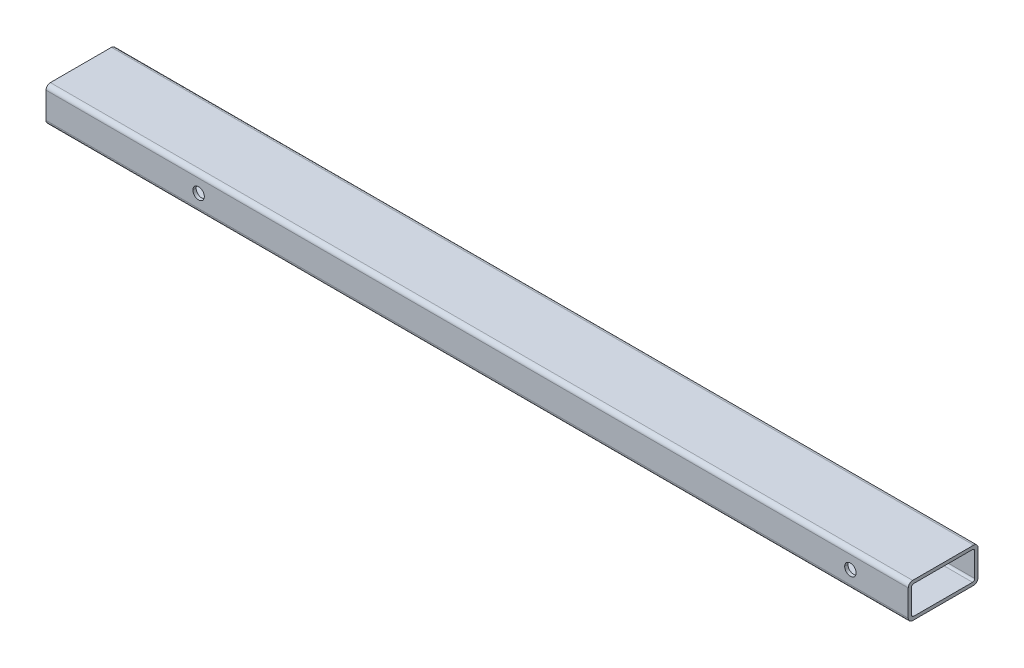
ISO-10303-21;
HEADER;
FILE_DESCRIPTION(('STEP AP214'),'2;1');
FILE_NAME('part.step','',(''),(''),'','','');
FILE_SCHEMA(('AUTOMOTIVE_DESIGN { 1 0 10303 214 1 1 1 1 }'));
ENDSEC;
DATA;
#1=APPLICATION_CONTEXT('core data for automotive mechanical design processes');
#2=APPLICATION_PROTOCOL_DEFINITION('international standard','automotive_design',2000,#1);
#3=PRODUCT_CONTEXT('',#1,'mechanical');
#4=PRODUCT('Part','Part','',(#3));
#5=PRODUCT_RELATED_PRODUCT_CATEGORY('part','',(#4));
#6=PRODUCT_DEFINITION_FORMATION('','',#4);
#7=PRODUCT_DEFINITION_CONTEXT('part definition',#1,'design');
#8=PRODUCT_DEFINITION('design','',#6,#7);
#9=PRODUCT_DEFINITION_SHAPE('','',#8);
#10=(LENGTH_UNIT() NAMED_UNIT(*) SI_UNIT(.MILLI.,.METRE.));
#11=(NAMED_UNIT(*) PLANE_ANGLE_UNIT() SI_UNIT($,.RADIAN.));
#12=(NAMED_UNIT(*) SI_UNIT($,.STERADIAN.) SOLID_ANGLE_UNIT());
#13=UNCERTAINTY_MEASURE_WITH_UNIT(LENGTH_MEASURE(1.E-05),#10,'distance_accuracy_value','');
#14=(GEOMETRIC_REPRESENTATION_CONTEXT(3) GLOBAL_UNCERTAINTY_ASSIGNED_CONTEXT((#13)) GLOBAL_UNIT_ASSIGNED_CONTEXT((#10,
#11,#12)) REPRESENTATION_CONTEXT('',''));
#15=CARTESIAN_POINT('',(0.,0.,0.));
#16=DIRECTION('',(0.,0.,1.));
#17=DIRECTION('',(1.,0.,0.));
#18=AXIS2_PLACEMENT_3D('',#15,#16,#17);
#19=CARTESIAN_POINT('',(-405.661151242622,0.,47.625));
#20=DIRECTION('',(0.,0.,1.));
#21=DIRECTION('',(1.,0.,0.));
#22=AXIS2_PLACEMENT_3D('',#19,#20,#21);
#23=CYLINDRICAL_SURFACE('',#22,8.334375);
#24=CARTESIAN_POINT('',(-405.661151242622,0.,50.8));
#25=DIRECTION('',(0.,0.,1.));
#26=DIRECTION('',(1.,0.,0.));
#27=AXIS2_PLACEMENT_3D('',#24,#25,#26);
#28=CIRCLE('',#27,8.334375);
#29=CARTESIAN_POINT('',(-413.995526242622,0.,50.8));
#30=VERTEX_POINT('',#29);
#31=CARTESIAN_POINT('',(-397.326776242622,0.,50.8));
#32=VERTEX_POINT('',#31);
#33=EDGE_CURVE('E175',#30,#32,#28,.F.);
#34=ORIENTED_EDGE('',*,*,#33,.F.);
#35=DIRECTION('',(0.,0.,1.));
#36=VECTOR('',#35,1.);
#37=CARTESIAN_POINT('',(-413.995526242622,0.,47.625));
#38=LINE('',#37,#36);
#39=CARTESIAN_POINT('',(-413.995526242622,0.,46.0375));
#40=VERTEX_POINT('',#39);
#41=EDGE_CURVE('E150',#30,#40,#38,.F.);
#42=ORIENTED_EDGE('',*,*,#41,.T.);
#43=CARTESIAN_POINT('',(-405.661151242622,0.,46.0375));
#44=DIRECTION('',(0.,0.,1.));
#45=DIRECTION('',(1.,0.,0.));
#46=AXIS2_PLACEMENT_3D('',#43,#44,#45);
#47=CIRCLE('',#46,8.334375);
#48=CARTESIAN_POINT('',(-397.326776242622,0.,46.0375));
#49=VERTEX_POINT('',#48);
#50=EDGE_CURVE('E19',#40,#49,#47,.F.);
#51=ORIENTED_EDGE('',*,*,#50,.T.);
#52=DIRECTION('',(0.,0.,1.));
#53=VECTOR('',#52,1.);
#54=CARTESIAN_POINT('',(-397.326776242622,0.,47.625));
#55=LINE('',#54,#53);
#56=EDGE_CURVE('E154',#49,#32,#55,.T.);
#57=ORIENTED_EDGE('',*,*,#56,.T.);
#58=EDGE_LOOP('',(#34,#42,#51,#57));
#59=FACE_BOUND('',#58,.T.);
#60=ADVANCED_FACE('F16',(#59),#23,.F.);
#61=CARTESIAN_POINT('',(-405.661151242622,0.,47.625));
#62=DIRECTION('',(0.,0.,1.));
#63=DIRECTION('',(1.,0.,0.));
#64=AXIS2_PLACEMENT_3D('',#61,#62,#63);
#65=CYLINDRICAL_SURFACE('',#64,8.334375);
#66=CARTESIAN_POINT('',(-405.661151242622,0.,46.0375));
#67=DIRECTION('',(0.,0.,1.));
#68=DIRECTION('',(1.,0.,0.));
#69=AXIS2_PLACEMENT_3D('',#66,#67,#68);
#70=CIRCLE('',#69,8.334375);
#71=EDGE_CURVE('E158',#49,#40,#70,.F.);
#72=ORIENTED_EDGE('',*,*,#71,.T.);
#73=ORIENTED_EDGE('',*,*,#41,.F.);
#74=CARTESIAN_POINT('',(-405.661151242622,0.,50.8));
#75=DIRECTION('',(0.,0.,1.));
#76=DIRECTION('',(1.,0.,0.));
#77=AXIS2_PLACEMENT_3D('',#74,#75,#76);
#78=CIRCLE('',#77,8.334375);
#79=EDGE_CURVE('E163',#32,#30,#78,.F.);
#80=ORIENTED_EDGE('',*,*,#79,.F.);
#81=ORIENTED_EDGE('',*,*,#56,.F.);
#82=EDGE_LOOP('',(#72,#73,#80,#81));
#83=FACE_BOUND('',#82,.T.);
#84=ADVANCED_FACE('F161',(#83),#65,.F.);
#85=CARTESIAN_POINT('',(543.663848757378,0.,47.625));
#86=DIRECTION('',(0.,0.,1.));
#87=DIRECTION('',(1.,0.,0.));
#88=AXIS2_PLACEMENT_3D('',#85,#86,#87);
#89=CYLINDRICAL_SURFACE('',#88,8.334375);
#90=CARTESIAN_POINT('',(543.663848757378,0.,50.8));
#91=DIRECTION('',(0.,0.,1.));
#92=DIRECTION('',(1.,0.,0.));
#93=AXIS2_PLACEMENT_3D('',#90,#91,#92);
#94=CIRCLE('',#93,8.334375);
#95=CARTESIAN_POINT('',(535.329473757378,0.,50.8));
#96=VERTEX_POINT('',#95);
#97=CARTESIAN_POINT('',(551.998223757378,0.,50.8));
#98=VERTEX_POINT('',#97);
#99=EDGE_CURVE('E179',#96,#98,#94,.F.);
#100=ORIENTED_EDGE('',*,*,#99,.F.);
#101=DIRECTION('',(0.,0.,1.));
#102=VECTOR('',#101,1.);
#103=CARTESIAN_POINT('',(535.329473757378,0.,47.625));
#104=LINE('',#103,#102);
#105=CARTESIAN_POINT('',(535.329473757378,0.,46.0375));
#106=VERTEX_POINT('',#105);
#107=EDGE_CURVE('E165',#96,#106,#104,.F.);
#108=ORIENTED_EDGE('',*,*,#107,.T.);
#109=CARTESIAN_POINT('',(543.663848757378,0.,46.0375));
#110=DIRECTION('',(0.,0.,1.));
#111=DIRECTION('',(1.,0.,0.));
#112=AXIS2_PLACEMENT_3D('',#109,#110,#111);
#113=CIRCLE('',#112,8.334375);
#114=CARTESIAN_POINT('',(551.998223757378,0.,46.0375));
#115=VERTEX_POINT('',#114);
#116=EDGE_CURVE('E168',#106,#115,#113,.F.);
#117=ORIENTED_EDGE('',*,*,#116,.T.);
#118=DIRECTION('',(0.,0.,1.));
#119=VECTOR('',#118,1.);
#120=CARTESIAN_POINT('',(551.998223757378,0.,47.625));
#121=LINE('',#120,#119);
#122=EDGE_CURVE('E246',#115,#98,#121,.T.);
#123=ORIENTED_EDGE('',*,*,#122,.T.);
#124=EDGE_LOOP('',(#100,#108,#117,#123));
#125=FACE_BOUND('',#124,.T.);
#126=ADVANCED_FACE('F495',(#125),#89,.F.);
#127=CARTESIAN_POINT('',(543.663848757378,0.,47.625));
#128=DIRECTION('',(0.,0.,1.));
#129=DIRECTION('',(1.,0.,0.));
#130=AXIS2_PLACEMENT_3D('',#127,#128,#129);
#131=CYLINDRICAL_SURFACE('',#130,8.334375);
#132=CARTESIAN_POINT('',(543.663848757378,0.,46.0375));
#133=DIRECTION('',(0.,0.,1.));
#134=DIRECTION('',(1.,0.,0.));
#135=AXIS2_PLACEMENT_3D('',#132,#133,#134);
#136=CIRCLE('',#135,8.334375);
#137=EDGE_CURVE('E169',#115,#106,#136,.F.);
#138=ORIENTED_EDGE('',*,*,#137,.T.);
#139=ORIENTED_EDGE('',*,*,#107,.F.);
#140=CARTESIAN_POINT('',(543.663848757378,0.,50.8));
#141=DIRECTION('',(0.,0.,1.));
#142=DIRECTION('',(1.,0.,0.));
#143=AXIS2_PLACEMENT_3D('',#140,#141,#142);
#144=CIRCLE('',#143,8.334375);
#145=EDGE_CURVE('E182',#98,#96,#144,.F.);
#146=ORIENTED_EDGE('',*,*,#145,.F.);
#147=ORIENTED_EDGE('',*,*,#122,.F.);
#148=EDGE_LOOP('',(#138,#139,#146,#147));
#149=FACE_BOUND('',#148,.T.);
#150=ADVANCED_FACE('F488',(#149),#131,.F.);
#151=CARTESIAN_POINT('',(-627.910973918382,-17.4625,-42.8625));
#152=DIRECTION('',(1.,0.,0.));
#153=DIRECTION('',(0.,0.,-1.));
#154=AXIS2_PLACEMENT_3D('',#151,#152,#153);
#155=CYLINDRICAL_SURFACE('',#154,3.175);
#156=DIRECTION('',(1.,0.,0.));
#157=VECTOR('',#156,1.);
#158=CARTESIAN_POINT('',(-627.910973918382,-17.4625,-46.0375000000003));
#159=LINE('',#158,#157);
#160=CARTESIAN_POINT('',(627.910973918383,-17.4625,-46.0375000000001));
#161=VERTEX_POINT('',#160);
#162=CARTESIAN_POINT('',(-627.910973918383,-17.4625,-46.0375000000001));
#163=VERTEX_POINT('',#162);
#164=EDGE_CURVE('E248',#161,#163,#159,.F.);
#165=ORIENTED_EDGE('',*,*,#164,.T.);
#166=CARTESIAN_POINT('',(-627.910973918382,-17.4625,-42.8625));
#167=DIRECTION('',(1.,0.,0.));
#168=DIRECTION('',(0.,0.,-1.));
#169=AXIS2_PLACEMENT_3D('',#166,#167,#168);
#170=CIRCLE('',#169,3.175);
#171=CARTESIAN_POINT('',(-627.910973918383,-20.6375,-42.8625));
#172=VERTEX_POINT('',#171);
#173=EDGE_CURVE('E211',#172,#163,#170,.T.);
#174=ORIENTED_EDGE('',*,*,#173,.F.);
#175=DIRECTION('',(1.,0.,0.));
#176=VECTOR('',#175,1.);
#177=CARTESIAN_POINT('',(-627.910973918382,-20.6375,-42.8625));
#178=LINE('',#177,#176);
#179=CARTESIAN_POINT('',(627.910973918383,-20.6375,-42.8625));
#180=VERTEX_POINT('',#179);
#181=EDGE_CURVE('E259',#172,#180,#178,.T.);
#182=ORIENTED_EDGE('',*,*,#181,.T.);
#183=CARTESIAN_POINT('',(627.910973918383,-17.4625,-42.8625));
#184=DIRECTION('',(1.,0.,0.));
#185=DIRECTION('',(0.,0.,-1.));
#186=AXIS2_PLACEMENT_3D('',#183,#184,#185);
#187=CIRCLE('',#186,3.175);
#188=EDGE_CURVE('E196',#180,#161,#187,.T.);
#189=ORIENTED_EDGE('',*,*,#188,.T.);
#190=EDGE_LOOP('',(#165,#174,#182,#189));
#191=FACE_BOUND('',#190,.T.);
#192=ADVANCED_FACE('F376',(#191),#155,.F.);
#193=CARTESIAN_POINT('',(-627.910973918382,17.4625,-46.0375000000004));
#194=DIRECTION('',(0.,0.,-1.));
#195=DIRECTION('',(0.,1.,0.));
#196=AXIS2_PLACEMENT_3D('',#193,#194,#195);
#197=PLANE('',#196);
#198=DIRECTION('',(1.,0.,0.));
#199=VECTOR('',#198,1.);
#200=CARTESIAN_POINT('',(-627.910973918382,17.4625,-46.0375000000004));
#201=LINE('',#200,#199);
#202=CARTESIAN_POINT('',(627.910973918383,17.4625,-46.0375000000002));
#203=VERTEX_POINT('',#202);
#204=CARTESIAN_POINT('',(-627.910973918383,17.4625,-46.0375000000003));
#205=VERTEX_POINT('',#204);
#206=EDGE_CURVE('E250',#203,#205,#201,.F.);
#207=ORIENTED_EDGE('',*,*,#206,.T.);
#208=DIRECTION('',(0.,1.,0.));
#209=VECTOR('',#208,1.);
#210=CARTESIAN_POINT('',(-627.910973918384,0.,-46.0375));
#211=LINE('',#210,#209);
#212=EDGE_CURVE('E214',#163,#205,#211,.T.);
#213=ORIENTED_EDGE('',*,*,#212,.F.);
#214=ORIENTED_EDGE('',*,*,#164,.F.);
#215=DIRECTION('',(0.,1.,0.));
#216=VECTOR('',#215,1.);
#217=CARTESIAN_POINT('',(627.910973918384,-19.05,-46.0375));
#218=LINE('',#217,#216);
#219=EDGE_CURVE('E189',#161,#203,#218,.T.);
#220=ORIENTED_EDGE('',*,*,#219,.T.);
#221=EDGE_LOOP('',(#207,#213,#214,#220));
#222=FACE_BOUND('',#221,.T.);
#223=ADVANCED_FACE('F373',(#222),#197,.F.);
#224=CARTESIAN_POINT('',(-627.910973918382,17.4625,-42.8625000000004));
#225=DIRECTION('',(1.,0.,0.));
#226=DIRECTION('',(0.,0.,-1.));
#227=AXIS2_PLACEMENT_3D('',#224,#225,#226);
#228=CYLINDRICAL_SURFACE('',#227,3.175);
#229=DIRECTION('',(1.,0.,0.));
#230=VECTOR('',#229,1.);
#231=CARTESIAN_POINT('',(-627.910973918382,20.6375000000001,-42.8625000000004));
#232=LINE('',#231,#230);
#233=CARTESIAN_POINT('',(627.910973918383,20.6375,-42.8625000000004));
#234=VERTEX_POINT('',#233);
#235=CARTESIAN_POINT('',(-627.910973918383,20.6375000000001,-42.8625000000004));
#236=VERTEX_POINT('',#235);
#237=EDGE_CURVE('E252',#234,#236,#232,.F.);
#238=ORIENTED_EDGE('',*,*,#237,.T.);
#239=CARTESIAN_POINT('',(-627.910973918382,17.4625,-42.8625000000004));
#240=DIRECTION('',(1.,0.,0.));
#241=DIRECTION('',(0.,0.,-1.));
#242=AXIS2_PLACEMENT_3D('',#239,#240,#241);
#243=CIRCLE('',#242,3.175);
#244=EDGE_CURVE('E215',#205,#236,#243,.T.);
#245=ORIENTED_EDGE('',*,*,#244,.F.);
#246=ORIENTED_EDGE('',*,*,#206,.F.);
#247=CARTESIAN_POINT('',(627.910973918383,17.4625,-42.8625000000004));
#248=DIRECTION('',(1.,0.,0.));
#249=DIRECTION('',(0.,0.,-1.));
#250=AXIS2_PLACEMENT_3D('',#247,#248,#249);
#251=CIRCLE('',#250,3.175);
#252=EDGE_CURVE('E186',#203,#234,#251,.T.);
#253=ORIENTED_EDGE('',*,*,#252,.T.);
#254=EDGE_LOOP('',(#238,#245,#246,#253));
#255=FACE_BOUND('',#254,.T.);
#256=ADVANCED_FACE('F370',(#255),#228,.F.);
#257=CARTESIAN_POINT('',(-627.910973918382,20.6375,42.8625));
#258=DIRECTION('',(0.,1.,0.));
#259=DIRECTION('',(0.,0.,1.));
#260=AXIS2_PLACEMENT_3D('',#257,#258,#259);
#261=PLANE('',#260);
#262=DIRECTION('',(1.,0.,0.));
#263=VECTOR('',#262,1.);
#264=CARTESIAN_POINT('',(-627.910973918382,20.6375,42.8625));
#265=LINE('',#264,#263);
#266=CARTESIAN_POINT('',(627.910973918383,20.6375,42.8625));
#267=VERTEX_POINT('',#266);
#268=CARTESIAN_POINT('',(-627.910973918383,20.6375,42.8625));
#269=VERTEX_POINT('',#268);
#270=EDGE_CURVE('E159',#267,#269,#265,.F.);
#271=ORIENTED_EDGE('',*,*,#270,.T.);
#272=DIRECTION('',(0.,0.,1.));
#273=VECTOR('',#272,1.);
#274=CARTESIAN_POINT('',(-627.910973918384,20.6375,0.));
#275=LINE('',#274,#273);
#276=EDGE_CURVE('E218',#236,#269,#275,.T.);
#277=ORIENTED_EDGE('',*,*,#276,.F.);
#278=ORIENTED_EDGE('',*,*,#237,.F.);
#279=DIRECTION('',(0.,0.,1.));
#280=VECTOR('',#279,1.);
#281=CARTESIAN_POINT('',(627.910973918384,20.6375,-50.8));
#282=LINE('',#281,#280);
#283=EDGE_CURVE('E188',#234,#267,#282,.T.);
#284=ORIENTED_EDGE('',*,*,#283,.T.);
#285=EDGE_LOOP('',(#271,#277,#278,#284));
#286=FACE_BOUND('',#285,.T.);
#287=ADVANCED_FACE('F366',(#286),#261,.F.);
#288=CARTESIAN_POINT('',(-627.910973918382,17.4625,42.8625));
#289=DIRECTION('',(1.,0.,0.));
#290=DIRECTION('',(0.,0.,-1.));
#291=AXIS2_PLACEMENT_3D('',#288,#289,#290);
#292=CYLINDRICAL_SURFACE('',#291,3.175);
#293=DIRECTION('',(1.,0.,0.));
#294=VECTOR('',#293,1.);
#295=CARTESIAN_POINT('',(-627.910973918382,17.4625,46.0375000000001));
#296=LINE('',#295,#294);
#297=CARTESIAN_POINT('',(627.910973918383,17.4625,46.0375));
#298=VERTEX_POINT('',#297);
#299=CARTESIAN_POINT('',(-627.910973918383,17.4625,46.0375000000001));
#300=VERTEX_POINT('',#299);
#301=EDGE_CURVE('E174',#298,#300,#296,.F.);
#302=ORIENTED_EDGE('',*,*,#301,.T.);
#303=CARTESIAN_POINT('',(-627.910973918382,17.4625,42.8625));
#304=DIRECTION('',(1.,0.,0.));
#305=DIRECTION('',(0.,0.,-1.));
#306=AXIS2_PLACEMENT_3D('',#303,#304,#305);
#307=CIRCLE('',#306,3.175);
#308=EDGE_CURVE('E219',#269,#300,#307,.T.);
#309=ORIENTED_EDGE('',*,*,#308,.F.);
#310=ORIENTED_EDGE('',*,*,#270,.F.);
#311=CARTESIAN_POINT('',(627.910973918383,17.4625,42.8625));
#312=DIRECTION('',(1.,0.,0.));
#313=DIRECTION('',(0.,0.,-1.));
#314=AXIS2_PLACEMENT_3D('',#311,#312,#313);
#315=CIRCLE('',#314,3.175);
#316=EDGE_CURVE('E190',#267,#298,#315,.T.);
#317=ORIENTED_EDGE('',*,*,#316,.T.);
#318=EDGE_LOOP('',(#302,#309,#310,#317));
#319=FACE_BOUND('',#318,.T.);
#320=ADVANCED_FACE('F362',(#319),#292,.F.);
#321=CARTESIAN_POINT('',(-627.910973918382,-17.4625,46.0375));
#322=DIRECTION('',(0.,0.,1.));
#323=DIRECTION('',(0.,-1.,0.));
#324=AXIS2_PLACEMENT_3D('',#321,#322,#323);
#325=PLANE('',#324);
#326=DIRECTION('',(1.,0.,0.));
#327=VECTOR('',#326,1.);
#328=CARTESIAN_POINT('',(-627.910973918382,-17.4625,46.0375));
#329=LINE('',#328,#327);
#330=CARTESIAN_POINT('',(627.910973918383,-17.4625,46.0375));
#331=VERTEX_POINT('',#330);
#332=CARTESIAN_POINT('',(-627.910973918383,-17.4625,46.0375));
#333=VERTEX_POINT('',#332);
#334=EDGE_CURVE('E256',#331,#333,#329,.F.);
#335=ORIENTED_EDGE('',*,*,#334,.T.);
#336=DIRECTION('',(0.,1.,0.));
#337=VECTOR('',#336,1.);
#338=CARTESIAN_POINT('',(-627.910973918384,0.,46.0375));
#339=LINE('',#338,#337);
#340=EDGE_CURVE('E222',#300,#333,#339,.F.);
#341=ORIENTED_EDGE('',*,*,#340,.F.);
#342=ORIENTED_EDGE('',*,*,#301,.F.);
#343=DIRECTION('',(0.,1.,0.));
#344=VECTOR('',#343,1.);
#345=CARTESIAN_POINT('',(627.910973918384,-19.05,46.0375));
#346=LINE('',#345,#344);
#347=EDGE_CURVE('E192',#298,#331,#346,.F.);
#348=ORIENTED_EDGE('',*,*,#347,.T.);
#349=EDGE_LOOP('',(#335,#341,#342,#348));
#350=FACE_BOUND('',#349,.T.);
#351=ORIENTED_EDGE('',*,*,#116,.F.);
#352=ORIENTED_EDGE('',*,*,#137,.F.);
#353=EDGE_LOOP('',(#351,#352));
#354=FACE_BOUND('',#353,.T.);
#355=ORIENTED_EDGE('',*,*,#50,.F.);
#356=ORIENTED_EDGE('',*,*,#71,.F.);
#357=EDGE_LOOP('',(#355,#356));
#358=FACE_BOUND('',#357,.T.);
#359=ADVANCED_FACE('F167',(#350,#354,#358),#325,.F.);
#360=CARTESIAN_POINT('',(-627.910973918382,-17.4625,42.8625));
#361=DIRECTION('',(1.,0.,0.));
#362=DIRECTION('',(0.,0.,-1.));
#363=AXIS2_PLACEMENT_3D('',#360,#361,#362);
#364=CYLINDRICAL_SURFACE('',#363,3.175);
#365=DIRECTION('',(1.,0.,0.));
#366=VECTOR('',#365,1.);
#367=CARTESIAN_POINT('',(-627.910973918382,-20.6374999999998,42.8625));
#368=LINE('',#367,#366);
#369=CARTESIAN_POINT('',(627.910973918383,-20.6374999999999,42.8625));
#370=VERTEX_POINT('',#369);
#371=CARTESIAN_POINT('',(-627.910973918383,-20.6374999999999,42.8625));
#372=VERTEX_POINT('',#371);
#373=EDGE_CURVE('E258',#370,#372,#368,.F.);
#374=ORIENTED_EDGE('',*,*,#373,.T.);
#375=CARTESIAN_POINT('',(-627.910973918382,-17.4625,42.8625));
#376=DIRECTION('',(1.,0.,0.));
#377=DIRECTION('',(0.,0.,-1.));
#378=AXIS2_PLACEMENT_3D('',#375,#376,#377);
#379=CIRCLE('',#378,3.175);
#380=EDGE_CURVE('E223',#333,#372,#379,.T.);
#381=ORIENTED_EDGE('',*,*,#380,.F.);
#382=ORIENTED_EDGE('',*,*,#334,.F.);
#383=CARTESIAN_POINT('',(627.910973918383,-17.4625,42.8625));
#384=DIRECTION('',(1.,0.,0.));
#385=DIRECTION('',(0.,0.,-1.));
#386=AXIS2_PLACEMENT_3D('',#383,#384,#385);
#387=CIRCLE('',#386,3.175);
#388=EDGE_CURVE('E193',#331,#370,#387,.T.);
#389=ORIENTED_EDGE('',*,*,#388,.T.);
#390=EDGE_LOOP('',(#374,#381,#382,#389));
#391=FACE_BOUND('',#390,.T.);
#392=ADVANCED_FACE('F351',(#391),#364,.F.);
#393=CARTESIAN_POINT('',(-627.910973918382,-20.6375,-42.8625));
#394=DIRECTION('',(0.,-1.,0.));
#395=DIRECTION('',(0.,0.,-1.));
#396=AXIS2_PLACEMENT_3D('',#393,#394,#395);
#397=PLANE('',#396);
#398=ORIENTED_EDGE('',*,*,#181,.F.);
#399=DIRECTION('',(0.,0.,1.));
#400=VECTOR('',#399,1.);
#401=CARTESIAN_POINT('',(-627.910973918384,-20.6375,0.));
#402=LINE('',#401,#400);
#403=EDGE_CURVE('E226',#372,#172,#402,.F.);
#404=ORIENTED_EDGE('',*,*,#403,.F.);
#405=ORIENTED_EDGE('',*,*,#373,.F.);
#406=DIRECTION('',(0.,0.,1.));
#407=VECTOR('',#406,1.);
#408=CARTESIAN_POINT('',(627.910973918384,-20.6375,-50.8));
#409=LINE('',#408,#407);
#410=EDGE_CURVE('E195',#370,#180,#409,.F.);
#411=ORIENTED_EDGE('',*,*,#410,.T.);
#412=EDGE_LOOP('',(#398,#404,#405,#411));
#413=FACE_BOUND('',#412,.T.);
#414=ADVANCED_FACE('F347',(#413),#397,.F.);
#415=CARTESIAN_POINT('',(-627.910973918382,19.05,-50.8));
#416=DIRECTION('',(0.,0.,-1.));
#417=DIRECTION('',(-1.,0.,0.));
#418=AXIS2_PLACEMENT_3D('',#415,#416,#417);
#419=PLANE('',#418);
#420=DIRECTION('',(0.,1.,0.));
#421=VECTOR('',#420,1.);
#422=CARTESIAN_POINT('',(-627.910973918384,0.,-50.8));
#423=LINE('',#422,#421);
#424=CARTESIAN_POINT('',(-627.910973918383,19.05,-50.8));
#425=VERTEX_POINT('',#424);
#426=CARTESIAN_POINT('',(-627.910973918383,-19.05,-50.8));
#427=VERTEX_POINT('',#426);
#428=EDGE_CURVE('E231',#425,#427,#423,.F.);
#429=ORIENTED_EDGE('',*,*,#428,.F.);
#430=DIRECTION('',(1.,0.,0.));
#431=VECTOR('',#430,1.);
#432=CARTESIAN_POINT('',(-627.910973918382,19.05,-50.8));
#433=LINE('',#432,#431);
#434=CARTESIAN_POINT('',(627.910973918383,19.05,-50.8));
#435=VERTEX_POINT('',#434);
#436=EDGE_CURVE('E210',#435,#425,#433,.F.);
#437=ORIENTED_EDGE('',*,*,#436,.F.);
#438=DIRECTION('',(0.,1.,0.));
#439=VECTOR('',#438,1.);
#440=CARTESIAN_POINT('',(627.910973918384,-19.05,-50.8));
#441=LINE('',#440,#439);
#442=CARTESIAN_POINT('',(627.910973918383,-19.05,-50.8));
#443=VERTEX_POINT('',#442);
#444=EDGE_CURVE('E207',#435,#443,#441,.F.);
#445=ORIENTED_EDGE('',*,*,#444,.T.);
#446=DIRECTION('',(1.,0.,0.));
#447=VECTOR('',#446,1.);
#448=CARTESIAN_POINT('',(-627.910973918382,-19.05,-50.8));
#449=LINE('',#448,#447);
#450=EDGE_CURVE('E261',#427,#443,#449,.T.);
#451=ORIENTED_EDGE('',*,*,#450,.F.);
#452=EDGE_LOOP('',(#429,#437,#445,#451));
#453=FACE_BOUND('',#452,.T.);
#454=ADVANCED_FACE('F322',(#453),#419,.T.);
#455=CARTESIAN_POINT('',(-627.910973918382,-19.05,-44.45));
#456=DIRECTION('',(1.,0.,0.));
#457=DIRECTION('',(0.,0.,-1.));
#458=AXIS2_PLACEMENT_3D('',#455,#456,#457);
#459=CYLINDRICAL_SURFACE('',#458,6.35);
#460=CARTESIAN_POINT('',(-627.910973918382,-19.05,-44.45));
#461=DIRECTION('',(1.,0.,0.));
#462=DIRECTION('',(0.,0.,-1.));
#463=AXIS2_PLACEMENT_3D('',#460,#461,#462);
#464=CIRCLE('',#463,6.35);
#465=CARTESIAN_POINT('',(-627.910973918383,-25.4,-44.45));
#466=VERTEX_POINT('',#465);
#467=EDGE_CURVE('E227',#427,#466,#464,.F.);
#468=ORIENTED_EDGE('',*,*,#467,.F.);
#469=ORIENTED_EDGE('',*,*,#450,.T.);
#470=CARTESIAN_POINT('',(627.910973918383,-19.05,-44.45));
#471=DIRECTION('',(1.,0.,0.));
#472=DIRECTION('',(0.,0.,-1.));
#473=AXIS2_PLACEMENT_3D('',#470,#471,#472);
#474=CIRCLE('',#473,6.35);
#475=CARTESIAN_POINT('',(627.910973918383,-25.4,-44.45));
#476=VERTEX_POINT('',#475);
#477=EDGE_CURVE('E203',#443,#476,#474,.F.);
#478=ORIENTED_EDGE('',*,*,#477,.T.);
#479=DIRECTION('',(1.,0.,0.));
#480=VECTOR('',#479,1.);
#481=CARTESIAN_POINT('',(-627.910973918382,-25.4,-44.45));
#482=LINE('',#481,#480);
#483=EDGE_CURVE('E265',#466,#476,#482,.T.);
#484=ORIENTED_EDGE('',*,*,#483,.F.);
#485=EDGE_LOOP('',(#468,#469,#478,#484));
#486=FACE_BOUND('',#485,.T.);
#487=ADVANCED_FACE('F326',(#486),#459,.T.);
#488=CARTESIAN_POINT('',(-627.910973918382,-25.4,-44.45));
#489=DIRECTION('',(0.,-1.,0.));
#490=DIRECTION('',(0.,0.,-1.));
#491=AXIS2_PLACEMENT_3D('',#488,#489,#490);
#492=PLANE('',#491);
#493=DIRECTION('',(0.,0.,1.));
#494=VECTOR('',#493,1.);
#495=CARTESIAN_POINT('',(-627.910973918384,-25.4,0.));
#496=LINE('',#495,#494);
#497=CARTESIAN_POINT('',(-627.910973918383,-25.4,44.45));
#498=VERTEX_POINT('',#497);
#499=EDGE_CURVE('E230',#466,#498,#496,.T.);
#500=ORIENTED_EDGE('',*,*,#499,.F.);
#501=ORIENTED_EDGE('',*,*,#483,.T.);
#502=DIRECTION('',(0.,0.,1.));
#503=VECTOR('',#502,1.);
#504=CARTESIAN_POINT('',(627.910973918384,-25.4,-50.8));
#505=LINE('',#504,#503);
#506=CARTESIAN_POINT('',(627.910973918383,-25.4,44.45));
#507=VERTEX_POINT('',#506);
#508=EDGE_CURVE('E199',#476,#507,#505,.T.);
#509=ORIENTED_EDGE('',*,*,#508,.T.);
#510=DIRECTION('',(1.,0.,0.));
#511=VECTOR('',#510,1.);
#512=CARTESIAN_POINT('',(-627.910973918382,-25.4,44.45));
#513=LINE('',#512,#511);
#514=EDGE_CURVE('E177',#498,#507,#513,.T.);
#515=ORIENTED_EDGE('',*,*,#514,.F.);
#516=EDGE_LOOP('',(#500,#501,#509,#515));
#517=FACE_BOUND('',#516,.T.);
#518=ADVANCED_FACE('F329',(#517),#492,.T.);
#519=CARTESIAN_POINT('',(-627.910973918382,-19.05,44.45));
#520=DIRECTION('',(1.,0.,0.));
#521=DIRECTION('',(0.,0.,-1.));
#522=AXIS2_PLACEMENT_3D('',#519,#520,#521);
#523=CYLINDRICAL_SURFACE('',#522,6.35);
#524=CARTESIAN_POINT('',(-627.910973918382,-19.05,44.45));
#525=DIRECTION('',(1.,0.,0.));
#526=DIRECTION('',(0.,0.,-1.));
#527=AXIS2_PLACEMENT_3D('',#524,#525,#526);
#528=CIRCLE('',#527,6.35);
#529=CARTESIAN_POINT('',(-627.910973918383,-19.05,50.8));
#530=VERTEX_POINT('',#529);
#531=EDGE_CURVE('E232',#498,#530,#528,.F.);
#532=ORIENTED_EDGE('',*,*,#531,.F.);
#533=ORIENTED_EDGE('',*,*,#514,.T.);
#534=CARTESIAN_POINT('',(627.910973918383,-19.05,44.45));
#535=DIRECTION('',(1.,0.,0.));
#536=DIRECTION('',(0.,0.,-1.));
#537=AXIS2_PLACEMENT_3D('',#534,#535,#536);
#538=CIRCLE('',#537,6.35);
#539=CARTESIAN_POINT('',(627.910973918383,-19.05,50.8));
#540=VERTEX_POINT('',#539);
#541=EDGE_CURVE('E200',#507,#540,#538,.F.);
#542=ORIENTED_EDGE('',*,*,#541,.T.);
#543=DIRECTION('',(1.,0.,0.));
#544=VECTOR('',#543,1.);
#545=CARTESIAN_POINT('',(-627.910973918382,-19.05,50.8));
#546=LINE('',#545,#544);
#547=EDGE_CURVE('E185',#530,#540,#546,.T.);
#548=ORIENTED_EDGE('',*,*,#547,.F.);
#549=EDGE_LOOP('',(#532,#533,#542,#548));
#550=FACE_BOUND('',#549,.T.);
#551=ADVANCED_FACE('F333',(#550),#523,.T.);
#552=CARTESIAN_POINT('',(-627.910973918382,-19.05,50.8));
#553=DIRECTION('',(0.,0.,1.));
#554=DIRECTION('',(1.,0.,0.));
#555=AXIS2_PLACEMENT_3D('',#552,#553,#554);
#556=PLANE('',#555);
#557=DIRECTION('',(0.,1.,0.));
#558=VECTOR('',#557,1.);
#559=CARTESIAN_POINT('',(-627.910973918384,0.,50.8));
#560=LINE('',#559,#558);
#561=CARTESIAN_POINT('',(-627.910973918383,19.05,50.8));
#562=VERTEX_POINT('',#561);
#563=EDGE_CURVE('E235',#530,#562,#560,.T.);
#564=ORIENTED_EDGE('',*,*,#563,.F.);
#565=ORIENTED_EDGE('',*,*,#547,.T.);
#566=DIRECTION('',(0.,1.,0.));
#567=VECTOR('',#566,1.);
#568=CARTESIAN_POINT('',(627.910973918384,-19.05,50.8));
#569=LINE('',#568,#567);
#570=CARTESIAN_POINT('',(627.910973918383,19.05,50.8));
#571=VERTEX_POINT('',#570);
#572=EDGE_CURVE('E202',#540,#571,#569,.T.);
#573=ORIENTED_EDGE('',*,*,#572,.T.);
#574=DIRECTION('',(1.,0.,0.));
#575=VECTOR('',#574,1.);
#576=CARTESIAN_POINT('',(-627.910973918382,19.05,50.8));
#577=LINE('',#576,#575);
#578=EDGE_CURVE('E243',#562,#571,#577,.T.);
#579=ORIENTED_EDGE('',*,*,#578,.F.);
#580=EDGE_LOOP('',(#564,#565,#573,#579));
#581=FACE_BOUND('',#580,.T.);
#582=ORIENTED_EDGE('',*,*,#99,.T.);
#583=ORIENTED_EDGE('',*,*,#145,.T.);
#584=EDGE_LOOP('',(#582,#583));
#585=FACE_BOUND('',#584,.T.);
#586=ORIENTED_EDGE('',*,*,#33,.T.);
#587=ORIENTED_EDGE('',*,*,#79,.T.);
#588=EDGE_LOOP('',(#586,#587));
#589=FACE_BOUND('',#588,.T.);
#590=ADVANCED_FACE('F309',(#581,#585,#589),#556,.T.);
#591=CARTESIAN_POINT('',(627.910973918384,-19.05,-50.8));
#592=DIRECTION('',(-1.,0.,0.));
#593=DIRECTION('',(0.,0.,1.));
#594=AXIS2_PLACEMENT_3D('',#591,#592,#593);
#595=PLANE('',#594);
#596=ORIENTED_EDGE('',*,*,#444,.F.);
#597=CARTESIAN_POINT('',(627.910973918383,19.05,-44.45));
#598=DIRECTION('',(1.,0.,0.));
#599=DIRECTION('',(0.,0.,-1.));
#600=AXIS2_PLACEMENT_3D('',#597,#598,#599);
#601=CIRCLE('',#600,6.35);
#602=CARTESIAN_POINT('',(627.910973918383,25.4,-44.45));
#603=VERTEX_POINT('',#602);
#604=EDGE_CURVE('E206',#603,#435,#601,.F.);
#605=ORIENTED_EDGE('',*,*,#604,.F.);
#606=DIRECTION('',(0.,0.,1.));
#607=VECTOR('',#606,1.);
#608=CARTESIAN_POINT('',(627.910973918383,25.4,44.45));
#609=LINE('',#608,#607);
#610=CARTESIAN_POINT('',(627.910973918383,25.4,44.45));
#611=VERTEX_POINT('',#610);
#612=EDGE_CURVE('E275',#611,#603,#609,.F.);
#613=ORIENTED_EDGE('',*,*,#612,.F.);
#614=CARTESIAN_POINT('',(627.910973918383,19.05,44.45));
#615=DIRECTION('',(1.,0.,0.));
#616=DIRECTION('',(0.,0.,-1.));
#617=AXIS2_PLACEMENT_3D('',#614,#615,#616);
#618=CIRCLE('',#617,6.35);
#619=EDGE_CURVE('E239',#571,#611,#618,.F.);
#620=ORIENTED_EDGE('',*,*,#619,.F.);
#621=ORIENTED_EDGE('',*,*,#572,.F.);
#622=ORIENTED_EDGE('',*,*,#541,.F.);
#623=ORIENTED_EDGE('',*,*,#508,.F.);
#624=ORIENTED_EDGE('',*,*,#477,.F.);
#625=EDGE_LOOP('',(#596,#605,#613,#620,#621,#622,#623,#624));
#626=FACE_BOUND('',#625,.T.);
#627=ORIENTED_EDGE('',*,*,#410,.F.);
#628=ORIENTED_EDGE('',*,*,#388,.F.);
#629=ORIENTED_EDGE('',*,*,#347,.F.);
#630=ORIENTED_EDGE('',*,*,#316,.F.);
#631=ORIENTED_EDGE('',*,*,#283,.F.);
#632=ORIENTED_EDGE('',*,*,#252,.F.);
#633=ORIENTED_EDGE('',*,*,#219,.F.);
#634=ORIENTED_EDGE('',*,*,#188,.F.);
#635=EDGE_LOOP('',(#627,#628,#629,#630,#631,#632,#633,#634));
#636=FACE_BOUND('',#635,.T.);
#637=ADVANCED_FACE('F335',(#626,#636),#595,.F.);
#638=CARTESIAN_POINT('',(-627.910973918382,19.05,-44.45));
#639=DIRECTION('',(1.,0.,0.));
#640=DIRECTION('',(0.,0.,-1.));
#641=AXIS2_PLACEMENT_3D('',#638,#639,#640);
#642=CYLINDRICAL_SURFACE('',#641,6.35);
#643=CARTESIAN_POINT('',(-627.910973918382,19.05,-44.45));
#644=DIRECTION('',(1.,0.,0.));
#645=DIRECTION('',(0.,0.,-1.));
#646=AXIS2_PLACEMENT_3D('',#643,#644,#645);
#647=CIRCLE('',#646,6.35);
#648=CARTESIAN_POINT('',(-627.910973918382,25.4,-44.45));
#649=VERTEX_POINT('',#648);
#650=EDGE_CURVE('E236',#649,#425,#647,.F.);
#651=ORIENTED_EDGE('',*,*,#650,.F.);
#652=DIRECTION('',(1.,0.,0.));
#653=VECTOR('',#652,1.);
#654=CARTESIAN_POINT('',(-627.910973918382,25.4,-44.45));
#655=LINE('',#654,#653);
#656=EDGE_CURVE('E285',#603,#649,#655,.F.);
#657=ORIENTED_EDGE('',*,*,#656,.F.);
#658=ORIENTED_EDGE('',*,*,#604,.T.);
#659=ORIENTED_EDGE('',*,*,#436,.T.);
#660=EDGE_LOOP('',(#651,#657,#658,#659));
#661=FACE_BOUND('',#660,.T.);
#662=ADVANCED_FACE('F319',(#661),#642,.T.);
#663=CARTESIAN_POINT('',(-627.910973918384,0.,0.));
#664=DIRECTION('',(-1.,0.,0.));
#665=DIRECTION('',(0.,0.,1.));
#666=AXIS2_PLACEMENT_3D('',#663,#664,#665);
#667=PLANE('',#666);
#668=DIRECTION('',(0.,0.,1.));
#669=VECTOR('',#668,1.);
#670=CARTESIAN_POINT('',(-627.910973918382,25.4,44.45));
#671=LINE('',#670,#669);
#672=CARTESIAN_POINT('',(-627.910973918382,25.4,44.45));
#673=VERTEX_POINT('',#672);
#674=EDGE_CURVE('E25',#649,#673,#671,.T.);
#675=ORIENTED_EDGE('',*,*,#674,.F.);
#676=ORIENTED_EDGE('',*,*,#650,.T.);
#677=ORIENTED_EDGE('',*,*,#428,.T.);
#678=ORIENTED_EDGE('',*,*,#467,.T.);
#679=ORIENTED_EDGE('',*,*,#499,.T.);
#680=ORIENTED_EDGE('',*,*,#531,.T.);
#681=ORIENTED_EDGE('',*,*,#563,.T.);
#682=CARTESIAN_POINT('',(-627.910973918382,19.05,44.45));
#683=DIRECTION('',(1.,0.,0.));
#684=DIRECTION('',(0.,0.,-1.));
#685=AXIS2_PLACEMENT_3D('',#682,#683,#684);
#686=CIRCLE('',#685,6.35);
#687=EDGE_CURVE('E34',#673,#562,#686,.T.);
#688=ORIENTED_EDGE('',*,*,#687,.F.);
#689=EDGE_LOOP('',(#675,#676,#677,#678,#679,#680,#681,#688));
#690=FACE_BOUND('',#689,.T.);
#691=ORIENTED_EDGE('',*,*,#380,.T.);
#692=ORIENTED_EDGE('',*,*,#403,.T.);
#693=ORIENTED_EDGE('',*,*,#173,.T.);
#694=ORIENTED_EDGE('',*,*,#212,.T.);
#695=ORIENTED_EDGE('',*,*,#244,.T.);
#696=ORIENTED_EDGE('',*,*,#276,.T.);
#697=ORIENTED_EDGE('',*,*,#308,.T.);
#698=ORIENTED_EDGE('',*,*,#340,.T.);
#699=EDGE_LOOP('',(#691,#692,#693,#694,#695,#696,#697,#698));
#700=FACE_BOUND('',#699,.T.);
#701=ADVANCED_FACE('F305',(#690,#700),#667,.T.);
#702=CARTESIAN_POINT('',(-627.910973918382,19.05,44.45));
#703=DIRECTION('',(1.,0.,0.));
#704=DIRECTION('',(0.,0.,-1.));
#705=AXIS2_PLACEMENT_3D('',#702,#703,#704);
#706=CYLINDRICAL_SURFACE('',#705,6.35);
#707=ORIENTED_EDGE('',*,*,#687,.T.);
#708=ORIENTED_EDGE('',*,*,#578,.T.);
#709=ORIENTED_EDGE('',*,*,#619,.T.);
#710=DIRECTION('',(1.,0.,0.));
#711=VECTOR('',#710,1.);
#712=CARTESIAN_POINT('',(-627.910973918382,25.4,44.45));
#713=LINE('',#712,#711);
#714=EDGE_CURVE('E11',#673,#611,#713,.T.);
#715=ORIENTED_EDGE('',*,*,#714,.F.);
#716=EDGE_LOOP('',(#707,#708,#709,#715));
#717=FACE_BOUND('',#716,.T.);
#718=ADVANCED_FACE('F314',(#717),#706,.T.);
#719=CARTESIAN_POINT('',(-627.910973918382,25.4,44.45));
#720=DIRECTION('',(0.,1.,0.));
#721=DIRECTION('',(0.,0.,1.));
#722=AXIS2_PLACEMENT_3D('',#719,#720,#721);
#723=PLANE('',#722);
#724=ORIENTED_EDGE('',*,*,#674,.T.);
#725=ORIENTED_EDGE('',*,*,#714,.T.);
#726=ORIENTED_EDGE('',*,*,#612,.T.);
#727=ORIENTED_EDGE('',*,*,#656,.T.);
#728=EDGE_LOOP('',(#724,#725,#726,#727));
#729=FACE_BOUND('',#728,.T.);
#730=ADVANCED_FACE('F316',(#729),#723,.T.);
#731=CLOSED_SHELL('',(#60,#84,#126,#150,#192,#223,#256,#287,#320,#359,#392,#414,#454,#487,#518,
#551,#590,#637,#662,#701,#718,#730));
#732=MANIFOLD_SOLID_BREP('B1',#731);
#733=ADVANCED_BREP_SHAPE_REPRESENTATION('',(#18,#732),#14);
#734=SHAPE_DEFINITION_REPRESENTATION(#9,#733);
ENDSEC;
END-ISO-10303-21;
